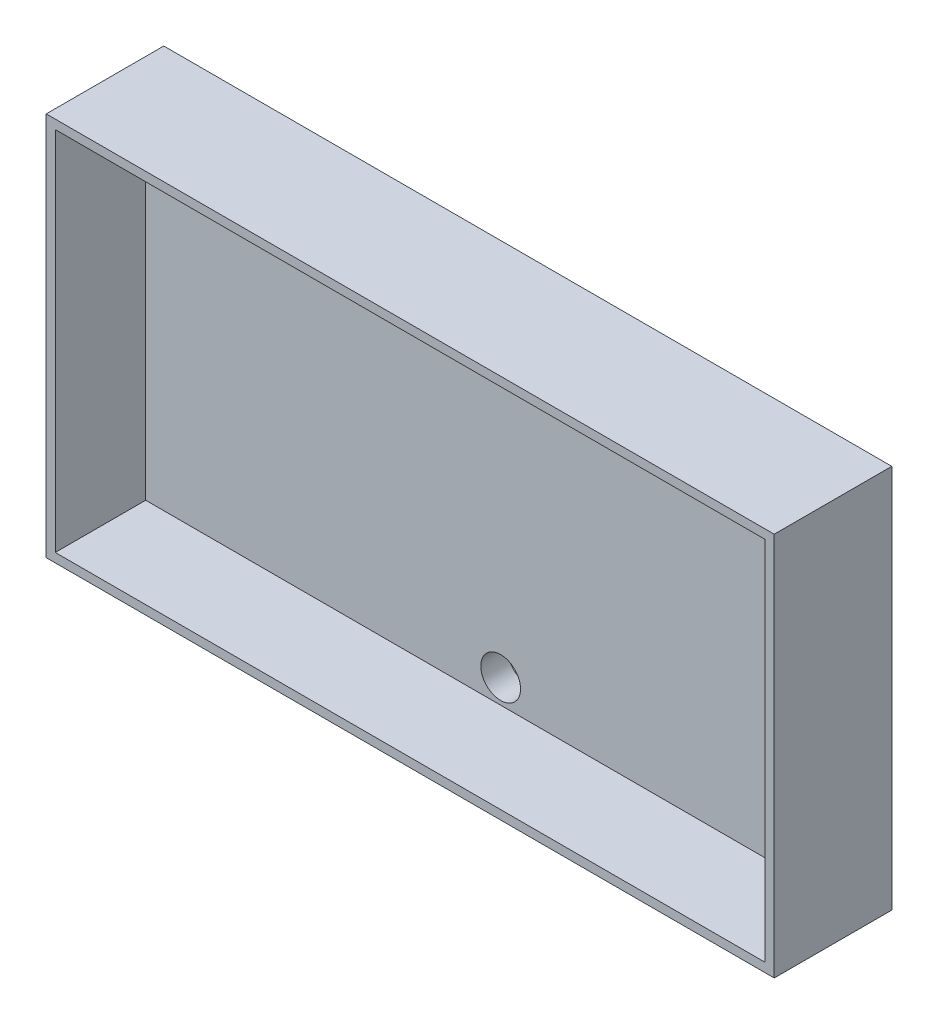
from build123d import *

# Parameters (mm, degrees)
SKETCH1_W                   = 80.5
SKETCH1_H                   = 42.5
SKETCH1_W_2                 = 78.5
SKETCH1_H_2                 = 40.5
VYSUNOUT_TENKOST_NN_1_DEPTH = 10
SKICA1_W                    = 80.5
SKICA1_H                    = 42.5
P_IDAT_VYSUNUT_M1_DEPTH     = 3
CUT_EXTRUDE2_DEPTH          = 47.60069742
CUT_EXTRUDE2_DEPTH_BACK     = 47.60069742
SKETCH3_R                   = 2.2


with BuildPart() as part:
    # Sketch1 → Vysunout tenkost_nn_1 (new body)
    with BuildSketch(Plane.XY):
        Rectangle(SKETCH1_W, SKETCH1_H)
        Rectangle(SKETCH1_W_2, SKETCH1_H_2, mode=Mode.SUBTRACT)
    extrude(amount=VYSUNOUT_TENKOST_NN_1_DEPTH)

    # Skica1 → P_idat vysunut_m1 (add)
    with BuildSketch(Plane.XY):
        Rectangle(SKICA1_W, SKICA1_H)
    extrude(amount=-P_IDAT_VYSUNUT_M1_DEPTH)

    # Sketch3 → Cut-Extrude2 (cut, two sides: drawn at the far end of the back side and taken through both)
    with BuildSketch(Plane.XY.offset(-CUT_EXTRUDE2_DEPTH_BACK)):
        with Locations((0, -17.6)):
            Circle(SKETCH3_R)
        with Locations((0, 17.6)):
            Circle(SKETCH3_R)
    extrude(amount=CUT_EXTRUDE2_DEPTH + CUT_EXTRUDE2_DEPTH_BACK, mode=Mode.SUBTRACT)


solid = part.part
